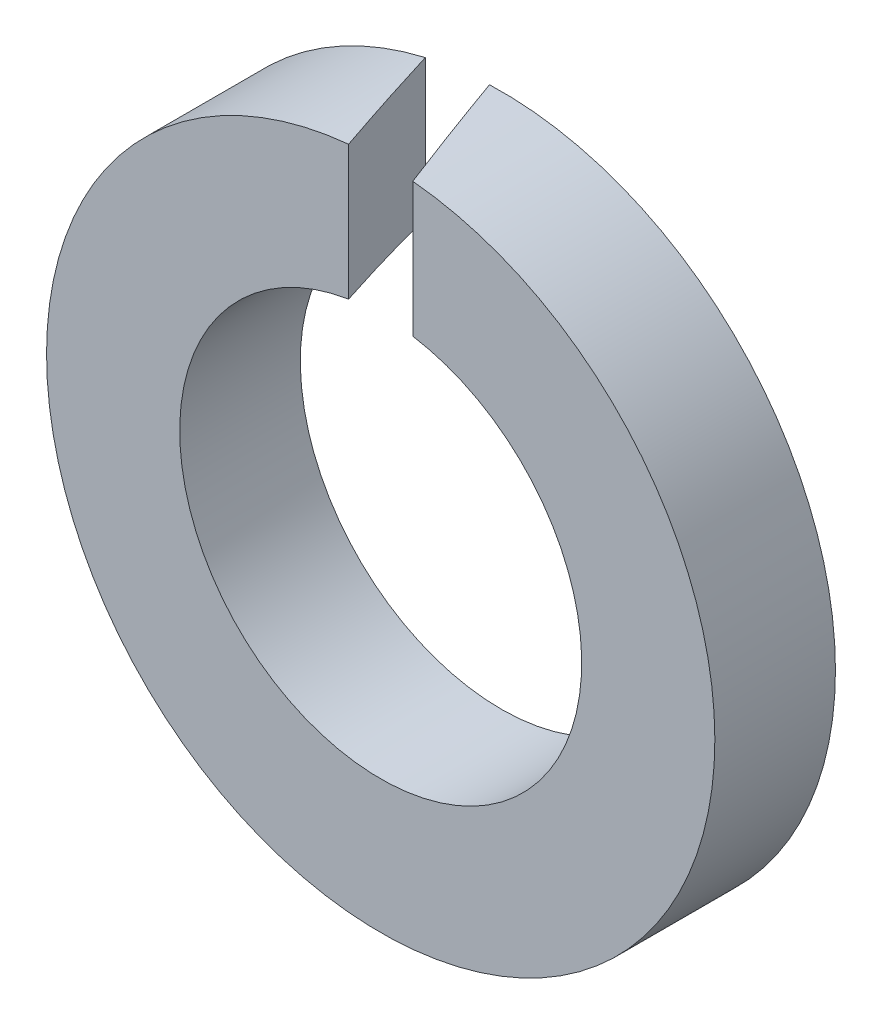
ISO-10303-21;
HEADER;
FILE_DESCRIPTION(('STEP AP214'),'2;1');
FILE_NAME('part.step','',(''),(''),'','','');
FILE_SCHEMA(('AUTOMOTIVE_DESIGN { 1 0 10303 214 1 1 1 1 }'));
ENDSEC;
DATA;
#1=APPLICATION_CONTEXT('core data for automotive mechanical design processes');
#2=APPLICATION_PROTOCOL_DEFINITION('international standard','automotive_design',2000,#1);
#3=PRODUCT_CONTEXT('',#1,'mechanical');
#4=PRODUCT('Part','Part','',(#3));
#5=PRODUCT_RELATED_PRODUCT_CATEGORY('part','',(#4));
#6=PRODUCT_DEFINITION_FORMATION('','',#4);
#7=PRODUCT_DEFINITION_CONTEXT('part definition',#1,'design');
#8=PRODUCT_DEFINITION('design','',#6,#7);
#9=PRODUCT_DEFINITION_SHAPE('','',#8);
#10=(LENGTH_UNIT() NAMED_UNIT(*) SI_UNIT(.MILLI.,.METRE.));
#11=(NAMED_UNIT(*) PLANE_ANGLE_UNIT() SI_UNIT($,.RADIAN.));
#12=(NAMED_UNIT(*) SI_UNIT($,.STERADIAN.) SOLID_ANGLE_UNIT());
#13=UNCERTAINTY_MEASURE_WITH_UNIT(LENGTH_MEASURE(1.E-05),#10,'distance_accuracy_value','');
#14=(GEOMETRIC_REPRESENTATION_CONTEXT(3) GLOBAL_UNCERTAINTY_ASSIGNED_CONTEXT((#13)) GLOBAL_UNIT_ASSIGNED_CONTEXT((#10,
#11,#12)) REPRESENTATION_CONTEXT('',''));
#15=CARTESIAN_POINT('',(0.,0.,0.));
#16=DIRECTION('',(0.,0.,1.));
#17=DIRECTION('',(1.,0.,0.));
#18=AXIS2_PLACEMENT_3D('',#15,#16,#17);
#19=CARTESIAN_POINT('',(0.,0.,-4.8));
#20=DIRECTION('',(0.,0.,1.));
#21=DIRECTION('',(1.,0.,0.));
#22=AXIS2_PLACEMENT_3D('',#19,#20,#21);
#23=CYLINDRICAL_SURFACE('',#22,13.3);
#24=CARTESIAN_POINT('',(0.,0.,-4.8));
#25=DIRECTION('',(0.,0.,1.));
#26=DIRECTION('',(1.,0.,0.));
#27=AXIS2_PLACEMENT_3D('',#24,#25,#26);
#28=CIRCLE('',#27,13.3);
#29=CARTESIAN_POINT('',(-3.02407045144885,12.9516407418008,-4.8));
#30=VERTEX_POINT('',#29);
#31=CARTESIAN_POINT('',(-0.470043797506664,13.291691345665,-4.8));
#32=VERTEX_POINT('',#31);
#33=EDGE_CURVE('E90',#30,#32,#28,.T.);
#34=ORIENTED_EDGE('',*,*,#33,.T.);
#35=CARTESIAN_POINT('',(0.,0.,-3.50856528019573));
#36=DIRECTION('',(-0.939692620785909,0.,0.342020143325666));
#37=DIRECTION('',(0.342020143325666,0.,0.939692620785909));
#38=AXIS2_PLACEMENT_3D('',#35,#36,#37);
#39=ELLIPSE('',#38,38.8865985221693,13.3);
#40=CARTESIAN_POINT('',(1.27701332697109,13.2385511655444,0.));
#41=VERTEX_POINT('',#40);
#42=EDGE_CURVE('E77',#32,#41,#39,.F.);
#43=ORIENTED_EDGE('',*,*,#42,.T.);
#44=CARTESIAN_POINT('',(0.,0.,0.));
#45=DIRECTION('',(0.,0.,1.));
#46=DIRECTION('',(1.,0.,0.));
#47=AXIS2_PLACEMENT_3D('',#44,#45,#46);
#48=CIRCLE('',#47,13.3);
#49=CARTESIAN_POINT('',(-1.27701332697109,13.2385511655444,0.));
#50=VERTEX_POINT('',#49);
#51=EDGE_CURVE('E85',#50,#41,#48,.T.);
#52=ORIENTED_EDGE('',*,*,#51,.F.);
#53=CARTESIAN_POINT('',(0.,0.,3.50856528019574));
#54=DIRECTION('',(0.939692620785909,0.,-0.342020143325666));
#55=DIRECTION('',(0.342020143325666,0.,0.939692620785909));
#56=AXIS2_PLACEMENT_3D('',#53,#54,#55);
#57=ELLIPSE('',#56,38.8865985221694,13.3);
#58=EDGE_CURVE('E69',#50,#30,#57,.F.);
#59=ORIENTED_EDGE('',*,*,#58,.T.);
#60=EDGE_LOOP('',(#34,#43,#52,#59));
#61=FACE_BOUND('',#60,.T.);
#62=ADVANCED_FACE('F32',(#61),#23,.T.);
#63=CARTESIAN_POINT('',(0.,0.,-4.8));
#64=DIRECTION('',(0.,0.,1.));
#65=DIRECTION('',(1.,0.,0.));
#66=AXIS2_PLACEMENT_3D('',#63,#64,#65);
#67=PLANE('',#66);
#68=DIRECTION('',(0.,-1.,0.));
#69=VECTOR('',#68,1.);
#70=CARTESIAN_POINT('',(-0.470043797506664,13.3,-4.8));
#71=LINE('',#70,#69);
#72=CARTESIAN_POINT('',(-0.470043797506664,7.98617923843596,-4.8));
#73=VERTEX_POINT('',#72);
#74=EDGE_CURVE('E53',#32,#73,#71,.T.);
#75=ORIENTED_EDGE('',*,*,#74,.F.);
#76=ORIENTED_EDGE('',*,*,#33,.F.);
#77=DIRECTION('',(0.,-1.,0.));
#78=VECTOR('',#77,1.);
#79=CARTESIAN_POINT('',(-3.02407045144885,13.3,-4.8));
#80=LINE('',#79,#78);
#81=CARTESIAN_POINT('',(-3.02407045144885,7.40641599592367,-4.8));
#82=VERTEX_POINT('',#81);
#83=EDGE_CURVE('E72',#30,#82,#80,.T.);
#84=ORIENTED_EDGE('',*,*,#83,.T.);
#85=CARTESIAN_POINT('',(0.,0.,-4.8));
#86=DIRECTION('',(0.,0.,1.));
#87=DIRECTION('',(1.,0.,0.));
#88=AXIS2_PLACEMENT_3D('',#85,#86,#87);
#89=CIRCLE('',#88,8.);
#90=EDGE_CURVE('E91',#82,#73,#89,.T.);
#91=ORIENTED_EDGE('',*,*,#90,.T.);
#92=EDGE_LOOP('',(#75,#76,#84,#91));
#93=FACE_BOUND('',#92,.T.);
#94=ADVANCED_FACE('F100',(#93),#67,.F.);
#95=CARTESIAN_POINT('',(0.,0.,0.));
#96=DIRECTION('',(0.,0.,1.));
#97=DIRECTION('',(1.,0.,0.));
#98=AXIS2_PLACEMENT_3D('',#95,#96,#97);
#99=PLANE('',#98);
#100=ORIENTED_EDGE('',*,*,#51,.T.);
#101=DIRECTION('',(0.,-1.,0.));
#102=VECTOR('',#101,1.);
#103=CARTESIAN_POINT('',(1.27701332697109,13.3,0.));
#104=LINE('',#103,#102);
#105=CARTESIAN_POINT('',(1.27701332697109,7.89741963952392,0.));
#106=VERTEX_POINT('',#105);
#107=EDGE_CURVE('E78',#41,#106,#104,.T.);
#108=ORIENTED_EDGE('',*,*,#107,.T.);
#109=CARTESIAN_POINT('',(0.,0.,0.));
#110=DIRECTION('',(0.,0.,1.));
#111=DIRECTION('',(1.,0.,0.));
#112=AXIS2_PLACEMENT_3D('',#109,#110,#111);
#113=CIRCLE('',#112,8.);
#114=CARTESIAN_POINT('',(-1.27701332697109,7.89741963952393,0.));
#115=VERTEX_POINT('',#114);
#116=EDGE_CURVE('E87',#115,#106,#113,.T.);
#117=ORIENTED_EDGE('',*,*,#116,.F.);
#118=DIRECTION('',(0.,-1.,0.));
#119=VECTOR('',#118,1.);
#120=CARTESIAN_POINT('',(-1.27701332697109,13.3,0.));
#121=LINE('',#120,#119);
#122=EDGE_CURVE('E46',#50,#115,#121,.T.);
#123=ORIENTED_EDGE('',*,*,#122,.F.);
#124=EDGE_LOOP('',(#100,#108,#117,#123));
#125=FACE_BOUND('',#124,.T.);
#126=ADVANCED_FACE('F83',(#125),#99,.T.);
#127=CARTESIAN_POINT('',(0.,0.,-4.8));
#128=DIRECTION('',(0.,0.,1.));
#129=DIRECTION('',(1.,0.,0.));
#130=AXIS2_PLACEMENT_3D('',#127,#128,#129);
#131=CYLINDRICAL_SURFACE('',#130,8.);
#132=CARTESIAN_POINT('',(0.,0.,-3.50856528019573));
#133=DIRECTION('',(-0.939692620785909,0.,0.342020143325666));
#134=DIRECTION('',(0.342020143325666,0.,0.939692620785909));
#135=AXIS2_PLACEMENT_3D('',#132,#133,#134);
#136=ELLIPSE('',#135,23.3904352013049,8.);
#137=EDGE_CURVE('E11',#73,#106,#136,.F.);
#138=ORIENTED_EDGE('',*,*,#137,.F.);
#139=ORIENTED_EDGE('',*,*,#90,.F.);
#140=CARTESIAN_POINT('',(0.,0.,3.50856528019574));
#141=DIRECTION('',(0.939692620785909,0.,-0.342020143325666));
#142=DIRECTION('',(0.342020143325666,0.,0.939692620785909));
#143=AXIS2_PLACEMENT_3D('',#140,#141,#142);
#144=ELLIPSE('',#143,23.3904352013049,8.);
#145=EDGE_CURVE('E39',#115,#82,#144,.F.);
#146=ORIENTED_EDGE('',*,*,#145,.F.);
#147=ORIENTED_EDGE('',*,*,#116,.T.);
#148=EDGE_LOOP('',(#138,#139,#146,#147));
#149=FACE_BOUND('',#148,.T.);
#150=ADVANCED_FACE('F102',(#149),#131,.F.);
#151=CARTESIAN_POINT('',(-1.27701332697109,13.3,0.));
#152=DIRECTION('',(0.939692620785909,0.,-0.342020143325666));
#153=DIRECTION('',(-0.342020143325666,0.,-0.939692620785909));
#154=AXIS2_PLACEMENT_3D('',#151,#152,#153);
#155=PLANE('',#154);
#156=ORIENTED_EDGE('',*,*,#122,.T.);
#157=ORIENTED_EDGE('',*,*,#145,.T.);
#158=ORIENTED_EDGE('',*,*,#83,.F.);
#159=ORIENTED_EDGE('',*,*,#58,.F.);
#160=EDGE_LOOP('',(#156,#157,#158,#159));
#161=FACE_BOUND('',#160,.T.);
#162=ADVANCED_FACE('F70',(#161),#155,.T.);
#163=CARTESIAN_POINT('',(1.27701332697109,13.3,0.));
#164=DIRECTION('',(-0.939692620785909,0.,0.342020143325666));
#165=DIRECTION('',(0.342020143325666,0.,0.939692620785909));
#166=AXIS2_PLACEMENT_3D('',#163,#164,#165);
#167=PLANE('',#166);
#168=ORIENTED_EDGE('',*,*,#74,.T.);
#169=ORIENTED_EDGE('',*,*,#137,.T.);
#170=ORIENTED_EDGE('',*,*,#107,.F.);
#171=ORIENTED_EDGE('',*,*,#42,.F.);
#172=EDGE_LOOP('',(#168,#169,#170,#171));
#173=FACE_BOUND('',#172,.T.);
#174=ADVANCED_FACE('F103',(#173),#167,.T.);
#175=CLOSED_SHELL('',(#62,#94,#126,#150,#162,#174));
#176=MANIFOLD_SOLID_BREP('B2',#175);
#177=ADVANCED_BREP_SHAPE_REPRESENTATION('',(#18,#176),#14);
#178=SHAPE_DEFINITION_REPRESENTATION(#9,#177);
ENDSEC;
END-ISO-10303-21;
